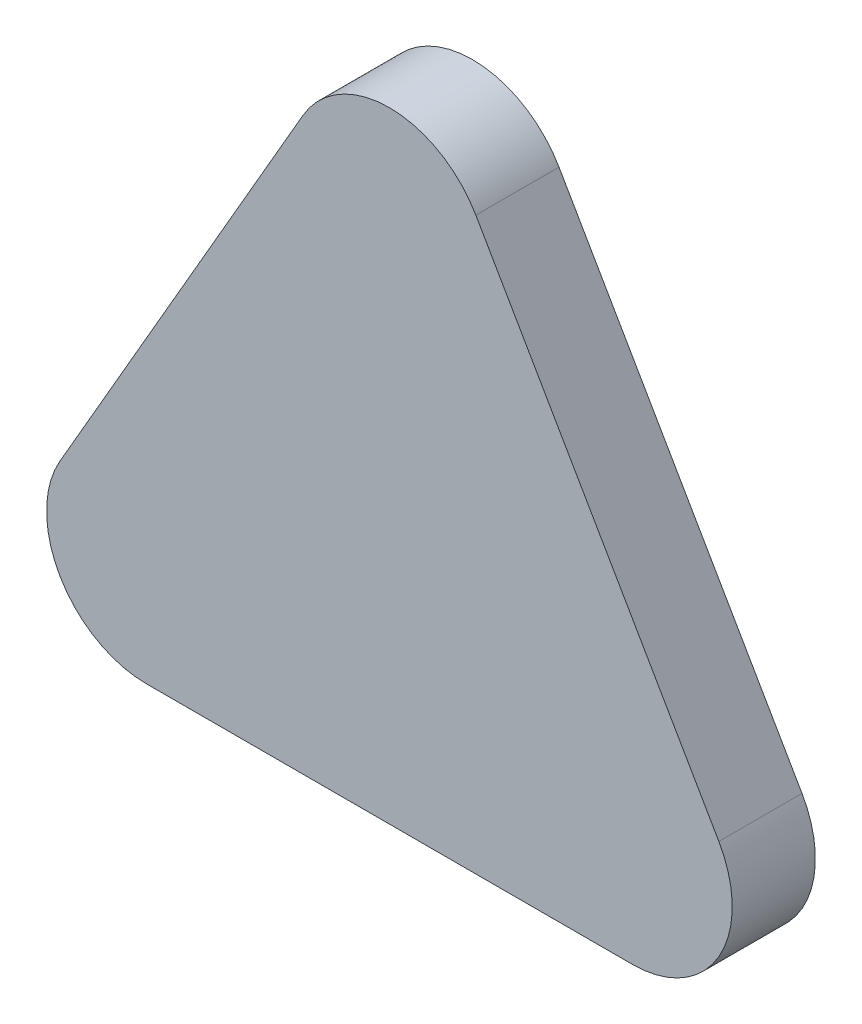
ISO-10303-21;
HEADER;
FILE_DESCRIPTION(('STEP AP214'),'2;1');
FILE_NAME('part.step','',(''),(''),'','','');
FILE_SCHEMA(('AUTOMOTIVE_DESIGN { 1 0 10303 214 1 1 1 1 }'));
ENDSEC;
DATA;
#1=APPLICATION_CONTEXT('core data for automotive mechanical design processes');
#2=APPLICATION_PROTOCOL_DEFINITION('international standard','automotive_design',2000,#1);
#3=PRODUCT_CONTEXT('',#1,'mechanical');
#4=PRODUCT('Part','Part','',(#3));
#5=PRODUCT_RELATED_PRODUCT_CATEGORY('part','',(#4));
#6=PRODUCT_DEFINITION_FORMATION('','',#4);
#7=PRODUCT_DEFINITION_CONTEXT('part definition',#1,'design');
#8=PRODUCT_DEFINITION('design','',#6,#7);
#9=PRODUCT_DEFINITION_SHAPE('','',#8);
#10=(LENGTH_UNIT() NAMED_UNIT(*) SI_UNIT(.MILLI.,.METRE.));
#11=(NAMED_UNIT(*) PLANE_ANGLE_UNIT() SI_UNIT($,.RADIAN.));
#12=(NAMED_UNIT(*) SI_UNIT($,.STERADIAN.) SOLID_ANGLE_UNIT());
#13=UNCERTAINTY_MEASURE_WITH_UNIT(LENGTH_MEASURE(1.E-05),#10,'distance_accuracy_value','');
#14=(GEOMETRIC_REPRESENTATION_CONTEXT(3) GLOBAL_UNCERTAINTY_ASSIGNED_CONTEXT((#13)) GLOBAL_UNIT_ASSIGNED_CONTEXT((#10,
#11,#12)) REPRESENTATION_CONTEXT('',''));
#15=CARTESIAN_POINT('',(0.,0.,0.));
#16=DIRECTION('',(0.,0.,1.));
#17=DIRECTION('',(1.,0.,0.));
#18=AXIS2_PLACEMENT_3D('',#15,#16,#17);
#19=CARTESIAN_POINT('',(0.,39.7526131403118,6.35));
#20=DIRECTION('',(0.,0.,-1.));
#21=DIRECTION('',(-1.,0.,0.));
#22=AXIS2_PLACEMENT_3D('',#19,#20,#21);
#23=CYLINDRICAL_SURFACE('',#22,7.62);
#24=CARTESIAN_POINT('',(0.,39.7526131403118,0.));
#25=DIRECTION('',(0.,0.,1.));
#26=DIRECTION('',(1.,0.,0.));
#27=AXIS2_PLACEMENT_3D('',#24,#25,#26);
#28=CIRCLE('',#27,7.62);
#29=CARTESIAN_POINT('',(6.59911357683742,43.5626131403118,0.));
#30=VERTEX_POINT('',#29);
#31=CARTESIAN_POINT('',(-6.59911357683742,43.5626131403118,0.));
#32=VERTEX_POINT('',#31);
#33=EDGE_CURVE('E80',#30,#32,#28,.T.);
#34=ORIENTED_EDGE('',*,*,#33,.T.);
#35=DIRECTION('',(0.,0.,-1.));
#36=VECTOR('',#35,1.);
#37=CARTESIAN_POINT('',(-6.59911357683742,43.5626131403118,6.35));
#38=LINE('',#37,#36);
#39=CARTESIAN_POINT('',(-6.59911357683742,43.5626131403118,6.35));
#40=VERTEX_POINT('',#39);
#41=EDGE_CURVE('E11',#40,#32,#38,.T.);
#42=ORIENTED_EDGE('',*,*,#41,.F.);
#43=CARTESIAN_POINT('',(0.,39.7526131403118,6.35));
#44=DIRECTION('',(0.,0.,1.));
#45=DIRECTION('',(1.,0.,0.));
#46=AXIS2_PLACEMENT_3D('',#43,#44,#45);
#47=CIRCLE('',#46,7.62);
#48=CARTESIAN_POINT('',(6.59911357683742,43.5626131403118,6.35));
#49=VERTEX_POINT('',#48);
#50=EDGE_CURVE('E103',#49,#40,#47,.T.);
#51=ORIENTED_EDGE('',*,*,#50,.F.);
#52=DIRECTION('',(0.,0.,-1.));
#53=VECTOR('',#52,1.);
#54=CARTESIAN_POINT('',(6.59911357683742,43.5626131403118,6.35));
#55=LINE('',#54,#53);
#56=EDGE_CURVE('E93',#49,#30,#55,.T.);
#57=ORIENTED_EDGE('',*,*,#56,.T.);
#58=EDGE_LOOP('',(#34,#42,#51,#57));
#59=FACE_BOUND('',#58,.T.);
#60=ADVANCED_FACE('F24',(#59),#23,.T.);
#61=CARTESIAN_POINT('',(-6.59911357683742,43.5626131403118,6.35));
#62=DIRECTION('',(0.866025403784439,-0.5,0.));
#63=DIRECTION('',(0.5,0.866025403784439,0.));
#64=AXIS2_PLACEMENT_3D('',#61,#62,#63);
#65=PLANE('',#64);
#66=DIRECTION('',(-0.5,-0.866025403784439,0.));
#67=VECTOR('',#66,1.);
#68=CARTESIAN_POINT('',(-6.59911357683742,43.5626131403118,0.));
#69=LINE('',#68,#67);
#70=CARTESIAN_POINT('',(-25.1508864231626,11.43,0.));
#71=VERTEX_POINT('',#70);
#72=EDGE_CURVE('E76',#32,#71,#69,.T.);
#73=ORIENTED_EDGE('',*,*,#72,.T.);
#74=DIRECTION('',(0.,0.,-1.));
#75=VECTOR('',#74,1.);
#76=CARTESIAN_POINT('',(-25.1508864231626,11.43,6.35));
#77=LINE('',#76,#75);
#78=CARTESIAN_POINT('',(-25.1508864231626,11.43,6.35));
#79=VERTEX_POINT('',#78);
#80=EDGE_CURVE('E31',#79,#71,#77,.T.);
#81=ORIENTED_EDGE('',*,*,#80,.F.);
#82=DIRECTION('',(-0.5,-0.866025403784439,0.));
#83=VECTOR('',#82,1.);
#84=CARTESIAN_POINT('',(-6.59911357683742,43.5626131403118,6.35));
#85=LINE('',#84,#83);
#86=EDGE_CURVE('E89',#40,#79,#85,.T.);
#87=ORIENTED_EDGE('',*,*,#86,.F.);
#88=ORIENTED_EDGE('',*,*,#41,.T.);
#89=EDGE_LOOP('',(#73,#81,#87,#88));
#90=FACE_BOUND('',#89,.T.);
#91=ADVANCED_FACE('F88',(#90),#65,.F.);
#92=CARTESIAN_POINT('',(-18.5517728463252,7.62,6.35));
#93=DIRECTION('',(0.,0.,-1.));
#94=DIRECTION('',(-1.,0.,0.));
#95=AXIS2_PLACEMENT_3D('',#92,#93,#94);
#96=CYLINDRICAL_SURFACE('',#95,7.62);
#97=CARTESIAN_POINT('',(-18.5517728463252,7.62,0.));
#98=DIRECTION('',(0.,0.,1.));
#99=DIRECTION('',(-1.,0.,0.));
#100=AXIS2_PLACEMENT_3D('',#97,#98,#99);
#101=CIRCLE('',#100,7.62);
#102=CARTESIAN_POINT('',(-18.5517728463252,0.,0.));
#103=VERTEX_POINT('',#102);
#104=EDGE_CURVE('E82',#71,#103,#101,.T.);
#105=ORIENTED_EDGE('',*,*,#104,.T.);
#106=DIRECTION('',(0.,0.,-1.));
#107=VECTOR('',#106,1.);
#108=CARTESIAN_POINT('',(-18.5517728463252,0.,6.35));
#109=LINE('',#108,#107);
#110=CARTESIAN_POINT('',(-18.5517728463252,0.,6.35));
#111=VERTEX_POINT('',#110);
#112=EDGE_CURVE('E119',#111,#103,#109,.T.);
#113=ORIENTED_EDGE('',*,*,#112,.F.);
#114=CARTESIAN_POINT('',(-18.5517728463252,7.62,6.35));
#115=DIRECTION('',(0.,0.,1.));
#116=DIRECTION('',(-1.,0.,0.));
#117=AXIS2_PLACEMENT_3D('',#114,#115,#116);
#118=CIRCLE('',#117,7.62);
#119=EDGE_CURVE('E106',#79,#111,#118,.T.);
#120=ORIENTED_EDGE('',*,*,#119,.F.);
#121=ORIENTED_EDGE('',*,*,#80,.T.);
#122=EDGE_LOOP('',(#105,#113,#120,#121));
#123=FACE_BOUND('',#122,.T.);
#124=ADVANCED_FACE('F123',(#123),#96,.T.);
#125=CARTESIAN_POINT('',(-18.5517728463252,0.,6.35));
#126=DIRECTION('',(0.,1.,0.));
#127=DIRECTION('',(0.,0.,1.));
#128=AXIS2_PLACEMENT_3D('',#125,#126,#127);
#129=PLANE('',#128);
#130=DIRECTION('',(1.,0.,0.));
#131=VECTOR('',#130,1.);
#132=CARTESIAN_POINT('',(-18.5517728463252,0.,0.));
#133=LINE('',#132,#131);
#134=CARTESIAN_POINT('',(18.5517728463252,0.,0.));
#135=VERTEX_POINT('',#134);
#136=EDGE_CURVE('E97',#103,#135,#133,.T.);
#137=ORIENTED_EDGE('',*,*,#136,.T.);
#138=DIRECTION('',(0.,0.,-1.));
#139=VECTOR('',#138,1.);
#140=CARTESIAN_POINT('',(18.5517728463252,0.,6.35));
#141=LINE('',#140,#139);
#142=CARTESIAN_POINT('',(18.5517728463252,0.,6.35));
#143=VERTEX_POINT('',#142);
#144=EDGE_CURVE('E116',#143,#135,#141,.T.);
#145=ORIENTED_EDGE('',*,*,#144,.F.);
#146=DIRECTION('',(1.,0.,0.));
#147=VECTOR('',#146,1.);
#148=CARTESIAN_POINT('',(-18.5517728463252,0.,6.35));
#149=LINE('',#148,#147);
#150=EDGE_CURVE('E108',#111,#143,#149,.T.);
#151=ORIENTED_EDGE('',*,*,#150,.F.);
#152=ORIENTED_EDGE('',*,*,#112,.T.);
#153=EDGE_LOOP('',(#137,#145,#151,#152));
#154=FACE_BOUND('',#153,.T.);
#155=ADVANCED_FACE('F129',(#154),#129,.F.);
#156=CARTESIAN_POINT('',(18.5517728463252,7.62,6.35));
#157=DIRECTION('',(0.,0.,-1.));
#158=DIRECTION('',(-1.,0.,0.));
#159=AXIS2_PLACEMENT_3D('',#156,#157,#158);
#160=CYLINDRICAL_SURFACE('',#159,7.62);
#161=CARTESIAN_POINT('',(18.5517728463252,7.62,0.));
#162=DIRECTION('',(0.,0.,1.));
#163=DIRECTION('',(1.,0.,0.));
#164=AXIS2_PLACEMENT_3D('',#161,#162,#163);
#165=CIRCLE('',#164,7.62);
#166=CARTESIAN_POINT('',(25.1508864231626,11.43,0.));
#167=VERTEX_POINT('',#166);
#168=EDGE_CURVE('E99',#135,#167,#165,.T.);
#169=ORIENTED_EDGE('',*,*,#168,.T.);
#170=DIRECTION('',(0.,0.,-1.));
#171=VECTOR('',#170,1.);
#172=CARTESIAN_POINT('',(25.1508864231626,11.43,6.35));
#173=LINE('',#172,#171);
#174=CARTESIAN_POINT('',(25.1508864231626,11.43,6.35));
#175=VERTEX_POINT('',#174);
#176=EDGE_CURVE('E113',#175,#167,#173,.T.);
#177=ORIENTED_EDGE('',*,*,#176,.F.);
#178=CARTESIAN_POINT('',(18.5517728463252,7.62,6.35));
#179=DIRECTION('',(0.,0.,1.));
#180=DIRECTION('',(1.,0.,0.));
#181=AXIS2_PLACEMENT_3D('',#178,#179,#180);
#182=CIRCLE('',#181,7.62);
#183=EDGE_CURVE('E43',#143,#175,#182,.T.);
#184=ORIENTED_EDGE('',*,*,#183,.F.);
#185=ORIENTED_EDGE('',*,*,#144,.T.);
#186=EDGE_LOOP('',(#169,#177,#184,#185));
#187=FACE_BOUND('',#186,.T.);
#188=ADVANCED_FACE('F132',(#187),#160,.T.);
#189=CARTESIAN_POINT('',(25.1508864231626,11.43,6.35));
#190=DIRECTION('',(-0.866025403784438,-0.5,0.));
#191=DIRECTION('',(0.5,-0.866025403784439,0.));
#192=AXIS2_PLACEMENT_3D('',#189,#190,#191);
#193=PLANE('',#192);
#194=DIRECTION('',(-0.5,0.866025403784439,0.));
#195=VECTOR('',#194,1.);
#196=CARTESIAN_POINT('',(25.1508864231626,11.43,0.));
#197=LINE('',#196,#195);
#198=EDGE_CURVE('E101',#167,#30,#197,.T.);
#199=ORIENTED_EDGE('',*,*,#198,.T.);
#200=ORIENTED_EDGE('',*,*,#56,.F.);
#201=DIRECTION('',(-0.5,0.866025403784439,0.));
#202=VECTOR('',#201,1.);
#203=CARTESIAN_POINT('',(25.1508864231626,11.43,6.35));
#204=LINE('',#203,#202);
#205=EDGE_CURVE('E38',#175,#49,#204,.T.);
#206=ORIENTED_EDGE('',*,*,#205,.F.);
#207=ORIENTED_EDGE('',*,*,#176,.T.);
#208=EDGE_LOOP('',(#199,#200,#206,#207));
#209=FACE_BOUND('',#208,.T.);
#210=ADVANCED_FACE('F134',(#209),#193,.F.);
#211=CARTESIAN_POINT('',(0.,39.7526131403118,6.35));
#212=DIRECTION('',(0.,0.,1.));
#213=DIRECTION('',(1.,0.,0.));
#214=AXIS2_PLACEMENT_3D('',#211,#212,#213);
#215=PLANE('',#214);
#216=ORIENTED_EDGE('',*,*,#50,.T.);
#217=ORIENTED_EDGE('',*,*,#86,.T.);
#218=ORIENTED_EDGE('',*,*,#119,.T.);
#219=ORIENTED_EDGE('',*,*,#150,.T.);
#220=ORIENTED_EDGE('',*,*,#183,.T.);
#221=ORIENTED_EDGE('',*,*,#205,.T.);
#222=EDGE_LOOP('',(#216,#217,#218,#219,#220,#221));
#223=FACE_BOUND('',#222,.T.);
#224=ADVANCED_FACE('F126',(#223),#215,.T.);
#225=CARTESIAN_POINT('',(0.,39.7526131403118,0.));
#226=DIRECTION('',(0.,0.,1.));
#227=DIRECTION('',(1.,0.,0.));
#228=AXIS2_PLACEMENT_3D('',#225,#226,#227);
#229=PLANE('',#228);
#230=ORIENTED_EDGE('',*,*,#33,.F.);
#231=ORIENTED_EDGE('',*,*,#198,.F.);
#232=ORIENTED_EDGE('',*,*,#168,.F.);
#233=ORIENTED_EDGE('',*,*,#136,.F.);
#234=ORIENTED_EDGE('',*,*,#104,.F.);
#235=ORIENTED_EDGE('',*,*,#72,.F.);
#236=EDGE_LOOP('',(#230,#231,#232,#233,#234,#235));
#237=FACE_BOUND('',#236,.T.);
#238=ADVANCED_FACE('F77',(#237),#229,.F.);
#239=CLOSED_SHELL('',(#60,#91,#124,#155,#188,#210,#224,#238));
#240=MANIFOLD_SOLID_BREP('B2',#239);
#241=ADVANCED_BREP_SHAPE_REPRESENTATION('',(#18,#240),#14);
#242=SHAPE_DEFINITION_REPRESENTATION(#9,#241);
ENDSEC;
END-ISO-10303-21;
